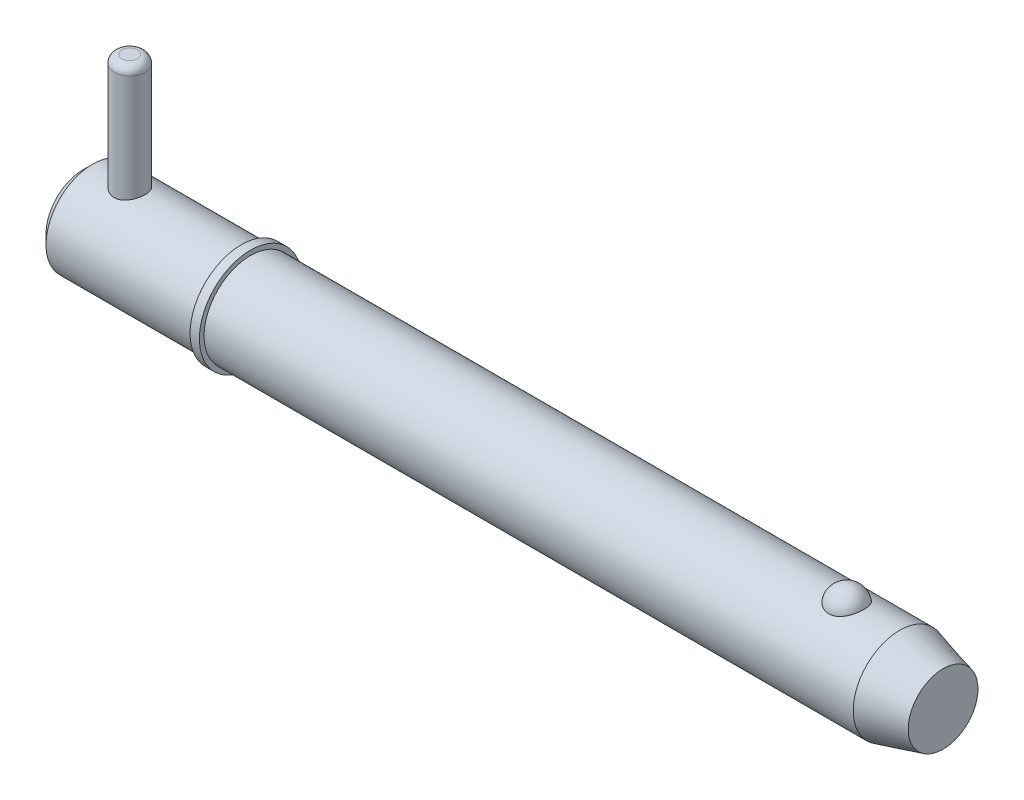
ISO-10303-21;
HEADER;
FILE_DESCRIPTION(('STEP AP214'),'2;1');
FILE_NAME('part.step','',(''),(''),'','','');
FILE_SCHEMA(('AUTOMOTIVE_DESIGN { 1 0 10303 214 1 1 1 1 }'));
ENDSEC;
DATA;
#1=APPLICATION_CONTEXT('core data for automotive mechanical design processes');
#2=APPLICATION_PROTOCOL_DEFINITION('international standard','automotive_design',2000,#1);
#3=PRODUCT_CONTEXT('',#1,'mechanical');
#4=PRODUCT('Part','Part','',(#3));
#5=PRODUCT_RELATED_PRODUCT_CATEGORY('part','',(#4));
#6=PRODUCT_DEFINITION_FORMATION('','',#4);
#7=PRODUCT_DEFINITION_CONTEXT('part definition',#1,'design');
#8=PRODUCT_DEFINITION('design','',#6,#7);
#9=PRODUCT_DEFINITION_SHAPE('','',#8);
#10=(LENGTH_UNIT() NAMED_UNIT(*) SI_UNIT(.MILLI.,.METRE.));
#11=(NAMED_UNIT(*) PLANE_ANGLE_UNIT() SI_UNIT($,.RADIAN.));
#12=(NAMED_UNIT(*) SI_UNIT($,.STERADIAN.) SOLID_ANGLE_UNIT());
#13=UNCERTAINTY_MEASURE_WITH_UNIT(LENGTH_MEASURE(1.E-05),#10,'distance_accuracy_value','');
#14=(GEOMETRIC_REPRESENTATION_CONTEXT(3) GLOBAL_UNCERTAINTY_ASSIGNED_CONTEXT((#13)) GLOBAL_UNIT_ASSIGNED_CONTEXT((#10,
#11,#12)) REPRESENTATION_CONTEXT('',''));
#15=CARTESIAN_POINT('',(0.,0.,0.));
#16=DIRECTION('',(0.,0.,1.));
#17=DIRECTION('',(1.,0.,0.));
#18=AXIS2_PLACEMENT_3D('',#15,#16,#17);
#19=CARTESIAN_POINT('',(7.14,24.605,0.));
#20=DIRECTION('',(0.,-1.,0.));
#21=DIRECTION('',(0.,0.,-1.));
#22=AXIS2_PLACEMENT_3D('',#19,#20,#21);
#23=CYLINDRICAL_SURFACE('',#22,2.38);
#24=CARTESIAN_POINT('',(7.14,-5.955,0.));
#25=DIRECTION('',(0.,1.,0.));
#26=DIRECTION('',(0.,0.,1.));
#27=AXIS2_PLACEMENT_3D('',#24,#25,#26);
#28=CIRCLE('',#27,2.38);
#29=CARTESIAN_POINT('',(7.14,-5.955,2.38));
#30=VERTEX_POINT('',#29);
#31=EDGE_CURVE('P0_E25',#30,#30,#28,.T.);
#32=ORIENTED_EDGE('',*,*,#31,.T.);
#33=EDGE_LOOP('',(#32));
#34=FACE_BOUND('',#33,.T.);
#35=CARTESIAN_POINT('',(7.14,23.415,0.));
#36=DIRECTION('',(0.,1.,0.));
#37=DIRECTION('',(0.,0.,1.));
#38=AXIS2_PLACEMENT_3D('',#35,#36,#37);
#39=CIRCLE('',#38,2.38);
#40=CARTESIAN_POINT('',(7.14,23.415,2.38));
#41=VERTEX_POINT('',#40);
#42=EDGE_CURVE('P0_E29',#41,#41,#39,.F.);
#43=ORIENTED_EDGE('',*,*,#42,.T.);
#44=EDGE_LOOP('',(#43));
#45=FACE_BOUND('',#44,.T.);
#46=ADVANCED_FACE('P0_F14',(#34,#45),#23,.T.);
#47=CARTESIAN_POINT('',(7.14,24.605,0.));
#48=DIRECTION('',(0.,1.,0.));
#49=DIRECTION('',(0.,0.,1.));
#50=AXIS2_PLACEMENT_3D('',#47,#48,#49);
#51=PLANE('',#50);
#52=CARTESIAN_POINT('',(7.14,24.605,0.));
#53=DIRECTION('',(0.,1.,0.));
#54=DIRECTION('',(0.,0.,1.));
#55=AXIS2_PLACEMENT_3D('',#52,#53,#54);
#56=CIRCLE('',#55,1.19);
#57=CARTESIAN_POINT('',(7.14,24.605,1.19));
#58=VERTEX_POINT('',#57);
#59=EDGE_CURVE('P0_E10',#58,#58,#56,.T.);
#60=ORIENTED_EDGE('',*,*,#59,.T.);
#61=EDGE_LOOP('',(#60));
#62=FACE_BOUND('',#61,.T.);
#63=ADVANCED_FACE('P0_F46',(#62),#51,.T.);
#64=CARTESIAN_POINT('',(7.14,-7.145,0.));
#65=DIRECTION('',(0.,1.,0.));
#66=DIRECTION('',(0.,0.,1.));
#67=AXIS2_PLACEMENT_3D('',#64,#65,#66);
#68=PLANE('',#67);
#69=CARTESIAN_POINT('',(7.14,-7.145,0.));
#70=DIRECTION('',(0.,1.,0.));
#71=DIRECTION('',(0.,0.,1.));
#72=AXIS2_PLACEMENT_3D('',#69,#70,#71);
#73=CIRCLE('',#72,1.19);
#74=CARTESIAN_POINT('',(7.14,-7.145,1.19));
#75=VERTEX_POINT('',#74);
#76=EDGE_CURVE('P0_E21',#75,#75,#73,.F.);
#77=ORIENTED_EDGE('',*,*,#76,.T.);
#78=EDGE_LOOP('',(#77));
#79=FACE_BOUND('',#78,.T.);
#80=ADVANCED_FACE('P0_F43',(#79),#68,.F.);
#81=CARTESIAN_POINT('',(7.14,-5.955,0.));
#82=DIRECTION('',(0.,1.,0.));
#83=DIRECTION('',(0.,0.,1.));
#84=AXIS2_PLACEMENT_3D('',#81,#82,#83);
#85=DEGENERATE_TOROIDAL_SURFACE('',#84,1.19,1.19,.T.);
#86=ORIENTED_EDGE('',*,*,#76,.F.);
#87=EDGE_LOOP('',(#86));
#88=FACE_BOUND('',#87,.T.);
#89=ORIENTED_EDGE('',*,*,#31,.F.);
#90=EDGE_LOOP('',(#89));
#91=FACE_BOUND('',#90,.T.);
#92=ADVANCED_FACE('P0_F38',(#88,#91),#85,.T.);
#93=CARTESIAN_POINT('',(7.14,23.415,0.));
#94=DIRECTION('',(0.,1.,0.));
#95=DIRECTION('',(0.,0.,1.));
#96=AXIS2_PLACEMENT_3D('',#93,#94,#95);
#97=DEGENERATE_TOROIDAL_SURFACE('',#96,1.19,1.19,.T.);
#98=ORIENTED_EDGE('',*,*,#42,.F.);
#99=EDGE_LOOP('',(#98));
#100=FACE_BOUND('',#99,.T.);
#101=ORIENTED_EDGE('',*,*,#59,.F.);
#102=EDGE_LOOP('',(#101));
#103=FACE_BOUND('',#102,.T.);
#104=ADVANCED_FACE('P0_F16',(#100,#103),#97,.T.);
#105=CLOSED_SHELL('',(#46,#63,#80,#92,#104));
#106=MANIFOLD_SOLID_BREP('P0_B1',#105);
#107=CARTESIAN_POINT('',(0.,0.,0.));
#108=DIRECTION('',(1.,0.,0.));
#109=DIRECTION('',(0.,0.,-1.));
#110=AXIS2_PLACEMENT_3D('',#107,#108,#109);
#111=CYLINDRICAL_SURFACE('',#110,7.145);
#112=CARTESIAN_POINT('',(125.38362424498,0.,0.));
#113=DIRECTION('',(1.,0.,0.));
#114=DIRECTION('',(0.,0.,-1.));
#115=AXIS2_PLACEMENT_3D('',#112,#113,#114);
#116=CIRCLE('',#115,7.145);
#117=CARTESIAN_POINT('',(125.38362424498,0.,-7.145));
#118=VERTEX_POINT('',#117);
#119=EDGE_CURVE('P1_E81',#118,#118,#116,.T.);
#120=ORIENTED_EDGE('',*,*,#119,.F.);
#121=EDGE_LOOP('',(#120));
#122=FACE_BOUND('',#121,.T.);
#123=CARTESIAN_POINT('',(25.7,0.,0.));
#124=DIRECTION('',(1.,0.,0.));
#125=DIRECTION('',(0.,0.,-1.));
#126=AXIS2_PLACEMENT_3D('',#123,#124,#125);
#127=CIRCLE('',#126,7.145);
#128=CARTESIAN_POINT('',(25.7,0.,-7.145));
#129=VERTEX_POINT('',#128);
#130=EDGE_CURVE('P1_E85',#129,#129,#127,.T.);
#131=ORIENTED_EDGE('',*,*,#130,.T.);
#132=EDGE_LOOP('',(#131));
#133=FACE_BOUND('',#132,.T.);
#134=CARTESIAN_POINT('',(117.239503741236,6.60328629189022,2.72903557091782));
#135=CARTESIAN_POINT('',(117.098315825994,6.60329644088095,2.72902496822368));
#136=CARTESIAN_POINT('',(116.956883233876,6.60799490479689,2.71772840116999));
#137=CARTESIAN_POINT('',(116.677955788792,6.62628236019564,2.67281935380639));
#138=CARTESIAN_POINT('',(116.540472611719,6.63989534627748,2.63914664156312));
#139=CARTESIAN_POINT('',(116.273889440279,6.67440775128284,2.55059642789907));
#140=CARTESIAN_POINT('',(116.144768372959,6.69528793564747,2.49577486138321));
#141=CARTESIAN_POINT('',(115.897869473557,6.74205585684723,2.36651799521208));
#142=CARTESIAN_POINT('',(115.780086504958,6.76794130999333,2.29209163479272));
#143=CARTESIAN_POINT('',(115.55516710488,6.82286177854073,2.12312937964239));
#144=CARTESIAN_POINT('',(115.448440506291,6.85196655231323,2.02807107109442));
#145=CARTESIAN_POINT('',(115.251918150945,6.90970232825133,1.82167822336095));
#146=CARTESIAN_POINT('',(115.162127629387,6.93833318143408,1.71033867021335));
#147=CARTESIAN_POINT('',(114.997667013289,6.9935167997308,1.46891951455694));
#148=CARTESIAN_POINT('',(114.923844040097,7.01992110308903,1.33822781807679));
#149=CARTESIAN_POINT('',(114.798088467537,7.06643385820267,1.0656656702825));
#150=CARTESIAN_POINT('',(114.74615735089,7.08654188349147,0.923794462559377));
#151=CARTESIAN_POINT('',(114.664732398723,7.11862399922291,0.630993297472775));
#152=CARTESIAN_POINT('',(114.635516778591,7.13049704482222,0.479974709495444));
#153=CARTESIAN_POINT('',(114.601174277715,7.14449484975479,0.174782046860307));
#154=CARTESIAN_POINT('',(114.596046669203,7.14661990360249,0.0206080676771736));
#155=CARTESIAN_POINT('',(114.609938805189,7.14092465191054,-0.285506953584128));
#156=CARTESIAN_POINT('',(114.628810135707,7.1331654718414,-0.437455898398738));
#157=CARTESIAN_POINT('',(114.690062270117,7.10859076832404,-0.73577860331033));
#158=CARTESIAN_POINT('',(114.732443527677,7.0917750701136,-0.882152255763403));
#159=CARTESIAN_POINT('',(114.839934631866,7.05076716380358,-1.16543149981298));
#160=CARTESIAN_POINT('',(114.905075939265,7.02656475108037,-1.30232366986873));
#161=CARTESIAN_POINT('',(115.056759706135,6.97329145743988,-1.56265907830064));
#162=CARTESIAN_POINT('',(115.143303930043,6.94422017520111,-1.68610120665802));
#163=CARTESIAN_POINT('',(115.336465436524,6.88415108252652,-1.91671004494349));
#164=CARTESIAN_POINT('',(115.443180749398,6.85314438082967,-2.02379244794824));
#165=CARTESIAN_POINT('',(115.673974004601,6.79282069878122,-2.21787433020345));
#166=CARTESIAN_POINT('',(115.798050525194,6.76350358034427,-2.30487545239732));
#167=CARTESIAN_POINT('',(116.057678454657,6.7106058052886,-2.45458647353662));
#168=CARTESIAN_POINT('',(116.192938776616,6.68691885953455,-2.5177624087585));
#169=CARTESIAN_POINT('',(116.473277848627,6.64741247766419,-2.62030218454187));
#170=CARTESIAN_POINT('',(116.618352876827,6.63159007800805,-2.65967499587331));
#171=CARTESIAN_POINT('',(116.906347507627,6.61038594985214,-2.71193301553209));
#172=CARTESIAN_POINT('',(117.04900807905,6.60451880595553,-2.72605165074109));
#173=CARTESIAN_POINT('',(117.33480047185,6.60240611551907,-2.73116688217));
#174=CARTESIAN_POINT('',(117.477932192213,6.60615862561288,-2.72216814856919));
#175=CARTESIAN_POINT('',(117.755848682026,6.6225609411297,-2.68200435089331));
#176=CARTESIAN_POINT('',(117.890754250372,6.63492533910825,-2.65154998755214));
#177=CARTESIAN_POINT('',(118.15332009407,6.66687445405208,-2.57015684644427));
#178=CARTESIAN_POINT('',(118.28097978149,6.68645975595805,-2.51921640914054));
#179=CARTESIAN_POINT('',(118.528577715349,6.73127274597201,-2.39693610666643));
#180=CARTESIAN_POINT('',(118.648287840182,6.7566138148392,-2.32517694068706));
#181=CARTESIAN_POINT('',(118.874159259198,6.8100600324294,-2.1636381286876));
#182=CARTESIAN_POINT('',(118.980317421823,6.83816581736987,-2.07385432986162));
#183=CARTESIAN_POINT('',(119.181862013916,6.89580469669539,-1.87357235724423));
#184=CARTESIAN_POINT('',(119.276440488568,6.92533863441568,-1.76226074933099));
#185=CARTESIAN_POINT('',(119.446332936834,6.98139526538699,-1.52511696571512));
#186=CARTESIAN_POINT('',(119.521643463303,7.0079174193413,-1.39928219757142));
#187=CARTESIAN_POINT('',(119.653595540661,7.05607625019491,-1.1321597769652));
#188=CARTESIAN_POINT('',(119.709568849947,7.07753119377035,-0.990508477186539));
#189=CARTESIAN_POINT('',(119.798296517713,7.11222355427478,-0.699154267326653));
#190=CARTESIAN_POINT('',(119.831050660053,7.12546089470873,-0.549451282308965));
#191=CARTESIAN_POINT('',(119.872689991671,7.1423758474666,-0.246120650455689));
#192=CARTESIAN_POINT('',(119.881558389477,7.14604673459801,-0.0924903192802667));
#193=CARTESIAN_POINT('',(119.875194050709,7.14343510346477,0.214181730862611));
#194=CARTESIAN_POINT('',(119.859961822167,7.13715279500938,0.367223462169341));
#195=CARTESIAN_POINT('',(119.805845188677,7.11532948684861,0.667595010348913));
#196=CARTESIAN_POINT('',(119.767077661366,7.09983424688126,0.814949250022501));
#197=CARTESIAN_POINT('',(119.666770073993,7.06119140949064,1.10063221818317));
#198=CARTESIAN_POINT('',(119.605228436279,7.03804328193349,1.23896032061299));
#199=CARTESIAN_POINT('',(119.460207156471,6.98632429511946,1.5035230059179));
#200=CARTESIAN_POINT('',(119.376606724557,6.95772382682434,1.62968561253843));
#201=CARTESIAN_POINT('',(119.18938046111,6.89823072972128,1.865543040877));
#202=CARTESIAN_POINT('',(119.085755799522,6.86733823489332,1.9752388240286));
#203=CARTESIAN_POINT('',(118.861076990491,6.80676456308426,2.17482293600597));
#204=CARTESIAN_POINT('',(118.740067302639,6.77708053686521,2.26476035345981));
#205=CARTESIAN_POINT('',(118.483340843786,6.7223050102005,2.42252989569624));
#206=CARTESIAN_POINT('',(118.34761851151,6.69721525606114,2.49035362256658));
#207=CARTESIAN_POINT('',(118.070402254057,6.65552591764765,2.59967646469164));
#208=CARTESIAN_POINT('',(117.929281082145,6.63865794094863,2.64202017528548));
#209=CARTESIAN_POINT('',(117.641444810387,6.61425039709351,2.70255841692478));
#210=CARTESIAN_POINT('',(117.494748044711,6.60668259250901,2.720826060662));
#211=CARTESIAN_POINT('',(117.311679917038,6.60358754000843,2.72830331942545));
#212=CARTESIAN_POINT('',(117.275599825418,6.60328369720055,2.72903828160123));
#213=CARTESIAN_POINT('',(117.239503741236,6.60328629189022,2.72903557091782));
#214=B_SPLINE_CURVE_WITH_KNOTS('',3,(#134,#135,#136,#137,#138,#139,#140,#141,#142,#143,#144,
#145,#146,#147,#148,#149,#150,#151,#152,#153,#154,#155,#156,#157,#158,#159,#160,#161,#162,#163,
#164,#165,#166,#167,#168,#169,#170,#171,#172,#173,#174,#175,#176,#177,#178,#179,#180,#181,#182,
#183,#184,#185,#186,#187,#188,#189,#190,#191,#192,#193,#194,#195,#196,#197,#198,#199,#200,#201,
#202,#203,#204,#205,#206,#207,#208,#209,#210,#211,#212,#213),.UNSPECIFIED.,.T.,.F.,(4,2,2,2,2,2,
2,2,2,2,2,2,2,2,2,2,2,2,2,2,2,2,2,2,2,2,2,2,2,2,2,2,2,2,2,2,2,2,2,4),(0.,0.423468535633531,
0.848081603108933,1.27157926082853,1.69488414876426,2.13051395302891,2.56627819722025,
3.0213670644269,3.47648674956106,3.93709649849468,4.39769233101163,4.85545355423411,
5.31322361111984,5.77162895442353,6.23007210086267,6.69080337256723,7.15149693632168,
7.60264329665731,8.05361952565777,8.48189729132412,8.91008854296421,9.32472524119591,
9.73939553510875,10.1630783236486,10.5868588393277,11.0319070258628,11.4770347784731,
11.9362874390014,12.3955443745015,12.855124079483,13.3146940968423,13.7720003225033,
14.2293382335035,14.6892343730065,15.1491036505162,15.6078171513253,16.0667046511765,
16.5093965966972,16.9507410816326,17.059004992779),.UNSPECIFIED.);
#215=CARTESIAN_POINT('',(117.239503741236,6.60328629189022,2.72903557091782));
#216=VERTEX_POINT('',#215);
#217=EDGE_CURVE('P1_E35',#216,#216,#214,.T.);
#218=ORIENTED_EDGE('',*,*,#217,.T.);
#219=EDGE_LOOP('',(#218));
#220=FACE_BOUND('',#219,.T.);
#221=ADVANCED_FACE('P1_F13',(#122,#133,#220),#111,.T.);
#222=CARTESIAN_POINT('',(0.,0.,0.));
#223=DIRECTION('',(-1.,0.,0.));
#224=DIRECTION('',(0.,0.,1.));
#225=AXIS2_PLACEMENT_3D('',#222,#223,#224);
#226=PLANE('',#225);
#227=CARTESIAN_POINT('',(0.,0.,0.));
#228=DIRECTION('',(1.,0.,0.));
#229=DIRECTION('',(0.,0.,-1.));
#230=AXIS2_PLACEMENT_3D('',#227,#228,#229);
#231=CIRCLE('',#230,5.716);
#232=CARTESIAN_POINT('',(0.,0.,-5.716));
#233=VERTEX_POINT('',#232);
#234=EDGE_CURVE('P1_E9',#233,#233,#231,.T.);
#235=ORIENTED_EDGE('',*,*,#234,.F.);
#236=EDGE_LOOP('',(#235));
#237=FACE_BOUND('',#236,.T.);
#238=ADVANCED_FACE('P1_F15',(#237),#226,.T.);
#239=CARTESIAN_POINT('',(1.42899999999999,0.,0.));
#240=DIRECTION('',(1.,0.,0.));
#241=DIRECTION('',(0.,0.,-1.));
#242=AXIS2_PLACEMENT_3D('',#239,#240,#241);
#243=CONICAL_SURFACE('',#242,7.145,0.78539816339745);
#244=ORIENTED_EDGE('',*,*,#234,.T.);
#245=EDGE_LOOP('',(#244));
#246=FACE_BOUND('',#245,.T.);
#247=CARTESIAN_POINT('',(1.42899999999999,0.,0.));
#248=DIRECTION('',(1.,0.,0.));
#249=DIRECTION('',(0.,0.,-1.));
#250=AXIS2_PLACEMENT_3D('',#247,#248,#249);
#251=CIRCLE('',#250,7.145);
#252=CARTESIAN_POINT('',(1.42899999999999,0.,-7.145));
#253=VERTEX_POINT('',#252);
#254=EDGE_CURVE('P1_E26',#253,#253,#251,.T.);
#255=ORIENTED_EDGE('',*,*,#254,.F.);
#256=EDGE_LOOP('',(#255));
#257=FACE_BOUND('',#256,.T.);
#258=ADVANCED_FACE('P1_F77',(#246,#257),#243,.T.);
#259=CARTESIAN_POINT('',(0.,0.,0.));
#260=DIRECTION('',(1.,0.,0.));
#261=DIRECTION('',(0.,0.,-1.));
#262=AXIS2_PLACEMENT_3D('',#259,#260,#261);
#263=CYLINDRICAL_SURFACE('',#262,7.145);
#264=CARTESIAN_POINT('',(7.14,-6.73695962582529,2.38));
#265=CARTESIAN_POINT('',(7.01035997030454,-6.73695921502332,2.38000059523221));
#266=CARTESIAN_POINT('',(6.88072348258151,-6.74074253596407,2.36937183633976));
#267=CARTESIAN_POINT('',(6.62529075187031,-6.75538853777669,2.32728080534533));
#268=CARTESIAN_POINT('',(6.49949514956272,-6.76625239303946,2.29581507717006));
#269=CARTESIAN_POINT('',(6.2554858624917,-6.79369535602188,2.21327763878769));
#270=CARTESIAN_POINT('',(6.13725786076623,-6.81026326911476,2.16224430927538));
#271=CARTESIAN_POINT('',(5.91100349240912,-6.84723128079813,2.04215132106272));
#272=CARTESIAN_POINT('',(5.80297937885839,-6.86763222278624,1.97308769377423));
#273=CARTESIAN_POINT('',(5.59597854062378,-6.91086152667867,1.81600414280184));
#274=CARTESIAN_POINT('',(5.49745861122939,-6.93375032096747,1.72739874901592));
#275=CARTESIAN_POINT('',(5.31636508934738,-6.97886546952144,1.53499636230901));
#276=CARTESIAN_POINT('',(5.23379405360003,-7.00109171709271,1.43119693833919));
#277=CARTESIAN_POINT('',(5.08487013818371,-7.04307708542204,1.20801318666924));
#278=CARTESIAN_POINT('',(5.01899578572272,-7.06275685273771,1.08829330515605));
#279=CARTESIAN_POINT('',(4.90850130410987,-7.09671988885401,0.838703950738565));
#280=CARTESIAN_POINT('',(4.86387545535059,-7.11100460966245,0.70883722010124));
#281=CARTESIAN_POINT('',(4.79869354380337,-7.13213998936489,0.44742990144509));
#282=CARTESIAN_POINT('',(4.77735497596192,-7.13923172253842,0.316104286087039));
#283=CARTESIAN_POINT('',(4.75686536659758,-7.14603777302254,0.0515578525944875));
#284=CARTESIAN_POINT('',(4.75770861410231,-7.14575398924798,-0.0816624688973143));
#285=CARTESIAN_POINT('',(4.78106216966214,-7.13800438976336,-0.340678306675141));
#286=CARTESIAN_POINT('',(4.80272255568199,-7.13082030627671,-0.466560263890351));
#287=CARTESIAN_POINT('',(4.86569013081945,-7.11043095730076,-0.712788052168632));
#288=CARTESIAN_POINT('',(4.90699865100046,-7.09722528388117,-0.833133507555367));
#289=CARTESIAN_POINT('',(5.00858673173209,-7.06591754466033,-1.06673173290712));
#290=CARTESIAN_POINT('',(5.06910834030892,-7.0477534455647,-1.17987058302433));
#291=CARTESIAN_POINT('',(5.20720514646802,-7.00841977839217,-1.39463797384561));
#292=CARTESIAN_POINT('',(5.28478508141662,-6.987249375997,-1.49626330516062));
#293=CARTESIAN_POINT('',(5.4590800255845,-6.94296010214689,-1.69017445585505));
#294=CARTESIAN_POINT('',(5.55652324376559,-6.91979641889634,-1.78179645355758));
#295=CARTESIAN_POINT('',(5.76558873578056,-6.87497076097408,-1.94761348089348));
#296=CARTESIAN_POINT('',(5.87721318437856,-6.85330901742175,-2.02180583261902));
#297=CARTESIAN_POINT('',(6.11357367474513,-6.81369485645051,-2.15157488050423));
#298=CARTESIAN_POINT('',(6.23847358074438,-6.79579956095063,-2.20687188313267));
#299=CARTESIAN_POINT('',(6.49655785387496,-6.76640630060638,-2.29542443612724));
#300=CARTESIAN_POINT('',(6.62973872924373,-6.75490565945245,-2.32868920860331));
#301=CARTESIAN_POINT('',(6.89417536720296,-6.74020933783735,-2.37088225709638));
#302=CARTESIAN_POINT('',(7.02524746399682,-6.73666278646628,-2.38083959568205));
#303=CARTESIAN_POINT('',(7.28721035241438,-6.73729555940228,-2.37904974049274));
#304=CARTESIAN_POINT('',(7.41810117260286,-6.7414734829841,-2.36730648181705));
#305=CARTESIAN_POINT('',(7.67130717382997,-6.75673471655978,-2.32337336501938));
#306=CARTESIAN_POINT('',(7.79376251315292,-6.76757635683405,-2.29189834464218));
#307=CARTESIAN_POINT('',(8.03162917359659,-6.79467771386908,-2.21025275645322));
#308=CARTESIAN_POINT('',(8.14703924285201,-6.8109383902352,-2.16007887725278));
#309=CARTESIAN_POINT('',(8.37159169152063,-6.84768362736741,-2.04065289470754));
#310=CARTESIAN_POINT('',(8.48041962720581,-6.86828569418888,-1.97084668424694));
#311=CARTESIAN_POINT('',(8.68518919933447,-6.91116416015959,-1.8147657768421));
#312=CARTESIAN_POINT('',(8.78112702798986,-6.93344105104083,-1.72848623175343));
#313=CARTESIAN_POINT('',(8.96215574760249,-6.97845348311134,-1.53698616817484));
#314=CARTESIAN_POINT('',(9.04650427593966,-7.00115965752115,-1.43105491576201));
#315=CARTESIAN_POINT('',(9.19627592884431,-7.04341676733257,-1.20598377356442));
#316=CARTESIAN_POINT('',(9.26169972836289,-7.06296781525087,-1.08684435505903));
#317=CARTESIAN_POINT('',(9.37116617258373,-7.0966205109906,-0.83933303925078));
#318=CARTESIAN_POINT('',(9.41534821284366,-7.11075755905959,-0.711027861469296));
#319=CARTESIAN_POINT('',(9.48132660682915,-7.13214194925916,-0.448245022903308));
#320=CARTESIAN_POINT('',(9.50313102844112,-7.13939177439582,-0.313769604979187));
#321=CARTESIAN_POINT('',(9.5230098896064,-7.14599771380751,-0.049254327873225));
#322=CARTESIAN_POINT('',(9.52215013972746,-7.14570837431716,0.0806974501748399));
#323=CARTESIAN_POINT('',(9.49935359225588,-7.13814116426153,0.338518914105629));
#324=CARTESIAN_POINT('',(9.47741850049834,-7.13086385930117,0.466388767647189));
#325=CARTESIAN_POINT('',(9.4138005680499,-7.11026814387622,0.714400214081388));
#326=CARTESIAN_POINT('',(9.37243609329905,-7.09704726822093,0.834632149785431));
#327=CARTESIAN_POINT('',(9.27142829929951,-7.06592602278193,1.06649582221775));
#328=CARTESIAN_POINT('',(9.2117816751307,-7.04802480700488,1.1781259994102));
#329=CARTESIAN_POINT('',(9.07336776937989,-7.00856499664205,1.39411030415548));
#330=CARTESIAN_POINT('',(8.99397590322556,-6.98689577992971,1.49804368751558));
#331=CARTESIAN_POINT('',(8.81938810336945,-6.9426110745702,1.69146078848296));
#332=CARTESIAN_POINT('',(8.72418713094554,-6.91999528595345,1.78093988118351));
#333=CARTESIAN_POINT('',(8.51623540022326,-6.87531507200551,1.94646188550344));
#334=CARTESIAN_POINT('',(8.4029442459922,-6.85330672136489,2.02184316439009));
#335=CARTESIAN_POINT('',(8.16461714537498,-6.81342065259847,2.1524427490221));
#336=CARTESIAN_POINT('',(8.03958429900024,-6.7955418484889,2.20766635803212));
#337=CARTESIAN_POINT('',(7.78712566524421,-6.76686117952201,2.29403636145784));
#338=CARTESIAN_POINT('',(7.66006989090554,-6.75577342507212,2.32616709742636));
#339=CARTESIAN_POINT('',(7.40200728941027,-6.74082409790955,2.36914495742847));
#340=CARTESIAN_POINT('',(7.27100183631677,-6.73696004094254,2.37999939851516));
#341=CARTESIAN_POINT('',(7.14,-6.73695962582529,2.38));
#342=B_SPLINE_CURVE_WITH_KNOTS('',3,(#264,#265,#266,#267,#268,#269,#270,#271,#272,#273,#274,
#275,#276,#277,#278,#279,#280,#281,#282,#283,#284,#285,#286,#287,#288,#289,#290,#291,#292,#293,
#294,#295,#296,#297,#298,#299,#300,#301,#302,#303,#304,#305,#306,#307,#308,#309,#310,#311,#312,
#313,#314,#315,#316,#317,#318,#319,#320,#321,#322,#323,#324,#325,#326,#327,#328,#329,#330,#331,
#332,#333,#334,#335,#336,#337,#338,#339,#340,#341),.UNSPECIFIED.,.T.,.F.,(4,2,2,2,2,2,2,2,2,2,2,
2,2,2,2,2,2,2,2,2,2,2,2,2,2,2,2,2,2,2,2,2,2,2,2,2,2,2,4),(0.,0.388434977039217,
0.776934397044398,1.16467566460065,1.55250234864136,1.9540847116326,2.35573139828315,
2.76784120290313,3.17984001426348,3.57752248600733,3.97510257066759,4.35711073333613,
4.7391447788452,5.12619663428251,5.51335611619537,5.91871976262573,6.3241456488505,
6.73533623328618,7.14635459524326,7.53885245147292,7.93127914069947,8.31025106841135,
8.68929014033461,9.08033871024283,9.47150254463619,9.88145528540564,10.2913934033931,
10.6986033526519,11.1056664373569,11.4936225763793,11.8815473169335,12.2633262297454,
12.645174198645,13.0411187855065,13.437189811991,13.8487371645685,14.2601761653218,
14.6528265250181,15.0453418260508),.UNSPECIFIED.);
#343=CARTESIAN_POINT('',(7.14,-6.73695962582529,2.38));
#344=VERTEX_POINT('',#343);
#345=EDGE_CURVE('P1_E17',#344,#344,#342,.T.);
#346=ORIENTED_EDGE('',*,*,#345,.F.);
#347=EDGE_LOOP('',(#346));
#348=FACE_BOUND('',#347,.T.);
#349=CARTESIAN_POINT('',(7.14,6.73695962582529,2.38));
#350=CARTESIAN_POINT('',(7.26964002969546,6.73695921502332,2.38000059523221));
#351=CARTESIAN_POINT('',(7.39927651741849,6.74074253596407,2.36937183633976));
#352=CARTESIAN_POINT('',(7.65470924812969,6.75538853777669,2.32728080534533));
#353=CARTESIAN_POINT('',(7.78050485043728,6.76625239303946,2.29581507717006));
#354=CARTESIAN_POINT('',(8.02451413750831,6.79369535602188,2.21327763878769));
#355=CARTESIAN_POINT('',(8.14274213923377,6.81026326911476,2.16224430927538));
#356=CARTESIAN_POINT('',(8.36899650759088,6.84723128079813,2.04215132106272));
#357=CARTESIAN_POINT('',(8.47702062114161,6.86763222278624,1.97308769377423));
#358=CARTESIAN_POINT('',(8.68402145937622,6.91086152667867,1.81600414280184));
#359=CARTESIAN_POINT('',(8.78254138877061,6.93375032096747,1.72739874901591));
#360=CARTESIAN_POINT('',(8.96363491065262,6.97886546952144,1.53499636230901));
#361=CARTESIAN_POINT('',(9.04620594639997,7.00109171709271,1.43119693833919));
#362=CARTESIAN_POINT('',(9.19512986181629,7.04307708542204,1.20801318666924));
#363=CARTESIAN_POINT('',(9.26100421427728,7.06275685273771,1.08829330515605));
#364=CARTESIAN_POINT('',(9.37149869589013,7.09671988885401,0.838703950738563));
#365=CARTESIAN_POINT('',(9.41612454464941,7.11100460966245,0.708837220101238));
#366=CARTESIAN_POINT('',(9.48130645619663,7.13213998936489,0.447429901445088));
#367=CARTESIAN_POINT('',(9.50264502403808,7.13923172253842,0.316104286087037));
#368=CARTESIAN_POINT('',(9.52313463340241,7.14603777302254,0.0515578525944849));
#369=CARTESIAN_POINT('',(9.52229138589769,7.14575398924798,-0.0816624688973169));
#370=CARTESIAN_POINT('',(9.49893783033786,7.13800438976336,-0.340678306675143));
#371=CARTESIAN_POINT('',(9.47727744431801,7.13082030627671,-0.466560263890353));
#372=CARTESIAN_POINT('',(9.41430986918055,7.11043095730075,-0.712788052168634));
#373=CARTESIAN_POINT('',(9.37300134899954,7.09722528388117,-0.833133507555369));
#374=CARTESIAN_POINT('',(9.27141326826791,7.06591754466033,-1.06673173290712));
#375=CARTESIAN_POINT('',(9.21089165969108,7.0477534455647,-1.17987058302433));
#376=CARTESIAN_POINT('',(9.07279485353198,7.00841977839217,-1.39463797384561));
#377=CARTESIAN_POINT('',(8.99521491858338,6.987249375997,-1.49626330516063));
#378=CARTESIAN_POINT('',(8.82091997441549,6.94296010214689,-1.69017445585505));
#379=CARTESIAN_POINT('',(8.72347675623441,6.91979641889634,-1.78179645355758));
#380=CARTESIAN_POINT('',(8.51441126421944,6.87497076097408,-1.94761348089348));
#381=CARTESIAN_POINT('',(8.40278681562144,6.85330901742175,-2.02180583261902));
#382=CARTESIAN_POINT('',(8.16642632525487,6.81369485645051,-2.15157488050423));
#383=CARTESIAN_POINT('',(8.04152641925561,6.79579956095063,-2.20687188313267));
#384=CARTESIAN_POINT('',(7.78344214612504,6.76640630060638,-2.29542443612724));
#385=CARTESIAN_POINT('',(7.65026127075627,6.75490565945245,-2.32868920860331));
#386=CARTESIAN_POINT('',(7.38582463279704,6.74020933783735,-2.37088225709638));
#387=CARTESIAN_POINT('',(7.25475253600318,6.73666278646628,-2.38083959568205));
#388=CARTESIAN_POINT('',(6.99278964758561,6.73729555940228,-2.37904974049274));
#389=CARTESIAN_POINT('',(6.86189882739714,6.7414734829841,-2.36730648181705));
#390=CARTESIAN_POINT('',(6.60869282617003,6.75673471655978,-2.32337336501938));
#391=CARTESIAN_POINT('',(6.48623748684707,6.76757635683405,-2.29189834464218));
#392=CARTESIAN_POINT('',(6.2483708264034,6.79467771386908,-2.21025275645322));
#393=CARTESIAN_POINT('',(6.13296075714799,6.8109383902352,-2.16007887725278));
#394=CARTESIAN_POINT('',(5.90840830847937,6.84768362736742,-2.04065289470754));
#395=CARTESIAN_POINT('',(5.79958037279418,6.86828569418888,-1.97084668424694));
#396=CARTESIAN_POINT('',(5.59481080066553,6.91116416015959,-1.8147657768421));
#397=CARTESIAN_POINT('',(5.49887297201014,6.93344105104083,-1.72848623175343));
#398=CARTESIAN_POINT('',(5.31784425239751,6.97845348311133,-1.53698616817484));
#399=CARTESIAN_POINT('',(5.23349572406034,7.00115965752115,-1.43105491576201));
#400=CARTESIAN_POINT('',(5.08372407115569,7.04341676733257,-1.20598377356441));
#401=CARTESIAN_POINT('',(5.01830027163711,7.06296781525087,-1.08684435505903));
#402=CARTESIAN_POINT('',(4.90883382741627,7.0966205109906,-0.839333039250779));
#403=CARTESIAN_POINT('',(4.86465178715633,7.11075755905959,-0.711027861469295));
#404=CARTESIAN_POINT('',(4.79867339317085,7.13214194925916,-0.448245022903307));
#405=CARTESIAN_POINT('',(4.77686897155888,7.13939177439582,-0.313769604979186));
#406=CARTESIAN_POINT('',(4.7569901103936,7.14599771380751,-0.0492543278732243));
#407=CARTESIAN_POINT('',(4.75784986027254,7.14570837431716,0.0806974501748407));
#408=CARTESIAN_POINT('',(4.78064640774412,7.13814116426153,0.33851891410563));
#409=CARTESIAN_POINT('',(4.80258149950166,7.13086385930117,0.46638876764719));
#410=CARTESIAN_POINT('',(4.8661994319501,7.11026814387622,0.714400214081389));
#411=CARTESIAN_POINT('',(4.90756390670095,7.09704726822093,0.834632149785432));
#412=CARTESIAN_POINT('',(5.00857170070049,7.06592602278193,1.06649582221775));
#413=CARTESIAN_POINT('',(5.0682183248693,7.04802480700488,1.1781259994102));
#414=CARTESIAN_POINT('',(5.20663223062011,7.00856499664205,1.39411030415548));
#415=CARTESIAN_POINT('',(5.28602409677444,6.98689577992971,1.49804368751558));
#416=CARTESIAN_POINT('',(5.46061189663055,6.9426110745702,1.69146078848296));
#417=CARTESIAN_POINT('',(5.55581286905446,6.91999528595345,1.78093988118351));
#418=CARTESIAN_POINT('',(5.76376459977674,6.87531507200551,1.94646188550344));
#419=CARTESIAN_POINT('',(5.8770557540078,6.85330672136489,2.02184316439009));
#420=CARTESIAN_POINT('',(6.11538285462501,6.81342065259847,2.1524427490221));
#421=CARTESIAN_POINT('',(6.24041570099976,6.7955418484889,2.20766635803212));
#422=CARTESIAN_POINT('',(6.4928743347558,6.76686117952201,2.29403636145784));
#423=CARTESIAN_POINT('',(6.61993010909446,6.75577342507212,2.32616709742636));
#424=CARTESIAN_POINT('',(6.87799271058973,6.74082409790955,2.36914495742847));
#425=CARTESIAN_POINT('',(7.00899816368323,6.73696004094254,2.37999939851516));
#426=CARTESIAN_POINT('',(7.14,6.73695962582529,2.38));
#427=B_SPLINE_CURVE_WITH_KNOTS('',3,(#349,#350,#351,#352,#353,#354,#355,#356,#357,#358,#359,
#360,#361,#362,#363,#364,#365,#366,#367,#368,#369,#370,#371,#372,#373,#374,#375,#376,#377,#378,
#379,#380,#381,#382,#383,#384,#385,#386,#387,#388,#389,#390,#391,#392,#393,#394,#395,#396,#397,
#398,#399,#400,#401,#402,#403,#404,#405,#406,#407,#408,#409,#410,#411,#412,#413,#414,#415,#416,
#417,#418,#419,#420,#421,#422,#423,#424,#425,#426),.UNSPECIFIED.,.T.,.F.,(4,2,2,2,2,2,2,2,2,2,2,
2,2,2,2,2,2,2,2,2,2,2,2,2,2,2,2,2,2,2,2,2,2,2,2,2,2,2,4),(0.,0.388434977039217,
0.776934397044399,1.16467566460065,1.55250234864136,1.9540847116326,2.35573139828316,
2.76784120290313,3.17984001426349,3.57752248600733,3.97510257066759,4.35711073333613,
4.73914477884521,5.12619663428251,5.51335611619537,5.91871976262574,6.3241456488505,
6.73533623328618,7.14635459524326,7.53885245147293,7.93127914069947,8.31025106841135,
8.68929014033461,9.08033871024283,9.47150254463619,9.88145528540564,10.2913934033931,
10.6986033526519,11.1056664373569,11.4936225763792,11.8815473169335,12.2633262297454,
12.645174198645,13.0411187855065,13.437189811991,13.8487371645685,14.2601761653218,
14.6528265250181,15.0453418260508),.UNSPECIFIED.);
#428=CARTESIAN_POINT('',(7.14,6.73695962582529,2.38));
#429=VERTEX_POINT('',#428);
#430=EDGE_CURVE('P1_E43',#429,#429,#427,.T.);
#431=ORIENTED_EDGE('',*,*,#430,.F.);
#432=EDGE_LOOP('',(#431));
#433=FACE_BOUND('',#432,.T.);
#434=ORIENTED_EDGE('',*,*,#254,.T.);
#435=EDGE_LOOP('',(#434));
#436=FACE_BOUND('',#435,.T.);
#437=CARTESIAN_POINT('',(24.271,0.,0.));
#438=DIRECTION('',(1.,0.,0.));
#439=DIRECTION('',(0.,0.,-1.));
#440=AXIS2_PLACEMENT_3D('',#437,#438,#439);
#441=CIRCLE('',#440,7.145);
#442=CARTESIAN_POINT('',(24.271,0.,-7.145));
#443=VERTEX_POINT('',#442);
#444=EDGE_CURVE('P1_E31',#443,#443,#441,.T.);
#445=ORIENTED_EDGE('',*,*,#444,.F.);
#446=EDGE_LOOP('',(#445));
#447=FACE_BOUND('',#446,.T.);
#448=ADVANCED_FACE('P1_F103',(#348,#433,#436,#447),#263,.T.);
#449=CARTESIAN_POINT('',(24.271,7.145,0.));
#450=DIRECTION('',(-1.,0.,0.));
#451=DIRECTION('',(0.,0.,1.));
#452=AXIS2_PLACEMENT_3D('',#449,#450,#451);
#453=PLANE('',#452);
#454=ORIENTED_EDGE('',*,*,#444,.T.);
#455=EDGE_LOOP('',(#454));
#456=FACE_BOUND('',#455,.T.);
#457=CARTESIAN_POINT('',(24.271,0.,0.));
#458=DIRECTION('',(1.,0.,0.));
#459=DIRECTION('',(0.,0.,-1.));
#460=AXIS2_PLACEMENT_3D('',#457,#458,#459);
#461=CIRCLE('',#460,7.8595);
#462=CARTESIAN_POINT('',(24.271,0.,-7.8595));
#463=VERTEX_POINT('',#462);
#464=EDGE_CURVE('P1_E91',#463,#463,#461,.T.);
#465=ORIENTED_EDGE('',*,*,#464,.F.);
#466=EDGE_LOOP('',(#465));
#467=FACE_BOUND('',#466,.T.);
#468=ADVANCED_FACE('P1_F100',(#456,#467),#453,.T.);
#469=CARTESIAN_POINT('',(0.,0.,0.));
#470=DIRECTION('',(1.,0.,0.));
#471=DIRECTION('',(0.,0.,-1.));
#472=AXIS2_PLACEMENT_3D('',#469,#470,#471);
#473=CYLINDRICAL_SURFACE('',#472,7.8595);
#474=ORIENTED_EDGE('',*,*,#464,.T.);
#475=EDGE_LOOP('',(#474));
#476=FACE_BOUND('',#475,.T.);
#477=CARTESIAN_POINT('',(25.7,0.,0.));
#478=DIRECTION('',(1.,0.,0.));
#479=DIRECTION('',(0.,0.,-1.));
#480=AXIS2_PLACEMENT_3D('',#477,#478,#479);
#481=CIRCLE('',#480,7.8595);
#482=CARTESIAN_POINT('',(25.7,0.,-7.8595));
#483=VERTEX_POINT('',#482);
#484=EDGE_CURVE('P1_E88',#483,#483,#481,.T.);
#485=ORIENTED_EDGE('',*,*,#484,.F.);
#486=EDGE_LOOP('',(#485));
#487=FACE_BOUND('',#486,.T.);
#488=ADVANCED_FACE('P1_F68',(#476,#487),#473,.T.);
#489=CARTESIAN_POINT('',(25.7,7.8595,0.));
#490=DIRECTION('',(1.,0.,0.));
#491=DIRECTION('',(0.,0.,-1.));
#492=AXIS2_PLACEMENT_3D('',#489,#490,#491);
#493=PLANE('',#492);
#494=ORIENTED_EDGE('',*,*,#484,.T.);
#495=EDGE_LOOP('',(#494));
#496=FACE_BOUND('',#495,.T.);
#497=ORIENTED_EDGE('',*,*,#130,.F.);
#498=EDGE_LOOP('',(#497));
#499=FACE_BOUND('',#498,.T.);
#500=ADVANCED_FACE('P1_F62',(#496,#499),#493,.T.);
#501=CARTESIAN_POINT('',(132.05,0.,0.));
#502=DIRECTION('',(-1.,0.,0.));
#503=DIRECTION('',(0.,0.,1.));
#504=AXIS2_PLACEMENT_3D('',#501,#502,#503);
#505=CONICAL_SURFACE('',#504,5.35875000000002,0.26179938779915);
#506=ORIENTED_EDGE('',*,*,#119,.T.);
#507=EDGE_LOOP('',(#506));
#508=FACE_BOUND('',#507,.T.);
#509=CARTESIAN_POINT('',(132.05,0.,0.));
#510=DIRECTION('',(1.,0.,0.));
#511=DIRECTION('',(0.,0.,-1.));
#512=AXIS2_PLACEMENT_3D('',#509,#510,#511);
#513=CIRCLE('',#512,5.35875000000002);
#514=CARTESIAN_POINT('',(132.05,0.,-5.35875000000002));
#515=VERTEX_POINT('',#514);
#516=EDGE_CURVE('P1_E42',#515,#515,#513,.T.);
#517=ORIENTED_EDGE('',*,*,#516,.F.);
#518=EDGE_LOOP('',(#517));
#519=FACE_BOUND('',#518,.T.);
#520=ADVANCED_FACE('P1_F59',(#508,#519),#505,.T.);
#521=CARTESIAN_POINT('',(132.05,5.35875000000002,0.));
#522=DIRECTION('',(1.,0.,0.));
#523=DIRECTION('',(0.,0.,-1.));
#524=AXIS2_PLACEMENT_3D('',#521,#522,#523);
#525=PLANE('',#524);
#526=ORIENTED_EDGE('',*,*,#516,.T.);
#527=EDGE_LOOP('',(#526));
#528=FACE_BOUND('',#527,.T.);
#529=ADVANCED_FACE('P1_F55',(#528),#525,.T.);
#530=CARTESIAN_POINT('',(117.239503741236,6.4305,0.));
#531=DIRECTION('',(-1.,0.,0.));
#532=DIRECTION('',(0.,-1.,0.));
#533=AXIS2_PLACEMENT_3D('',#530,#531,#532);
#534=SPHERICAL_SURFACE('',#533,2.73449999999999);
#535=ORIENTED_EDGE('',*,*,#217,.F.);
#536=EDGE_LOOP('',(#535));
#537=FACE_BOUND('',#536,.T.);
#538=ADVANCED_FACE('P1_F50',(#537),#534,.T.);
#539=CARTESIAN_POINT('',(7.14,-7.8595,0.));
#540=DIRECTION('',(0.,1.,0.));
#541=DIRECTION('',(0.,0.,1.));
#542=AXIS2_PLACEMENT_3D('',#539,#540,#541);
#543=CYLINDRICAL_SURFACE('',#542,2.38);
#544=ORIENTED_EDGE('',*,*,#345,.T.);
#545=EDGE_LOOP('',(#544));
#546=FACE_BOUND('',#545,.T.);
#547=ORIENTED_EDGE('',*,*,#430,.T.);
#548=EDGE_LOOP('',(#547));
#549=FACE_BOUND('',#548,.T.);
#550=ADVANCED_FACE('P1_F54',(#546,#549),#543,.F.);
#551=CLOSED_SHELL('',(#221,#238,#258,#448,#468,#488,#500,#520,#529,#538,#550));
#552=MANIFOLD_SOLID_BREP('P1_B1',#551);
#553=ADVANCED_BREP_SHAPE_REPRESENTATION('',(#18,#106,#552),#14);
#554=SHAPE_DEFINITION_REPRESENTATION(#9,#553);
ENDSEC;
END-ISO-10303-21;
